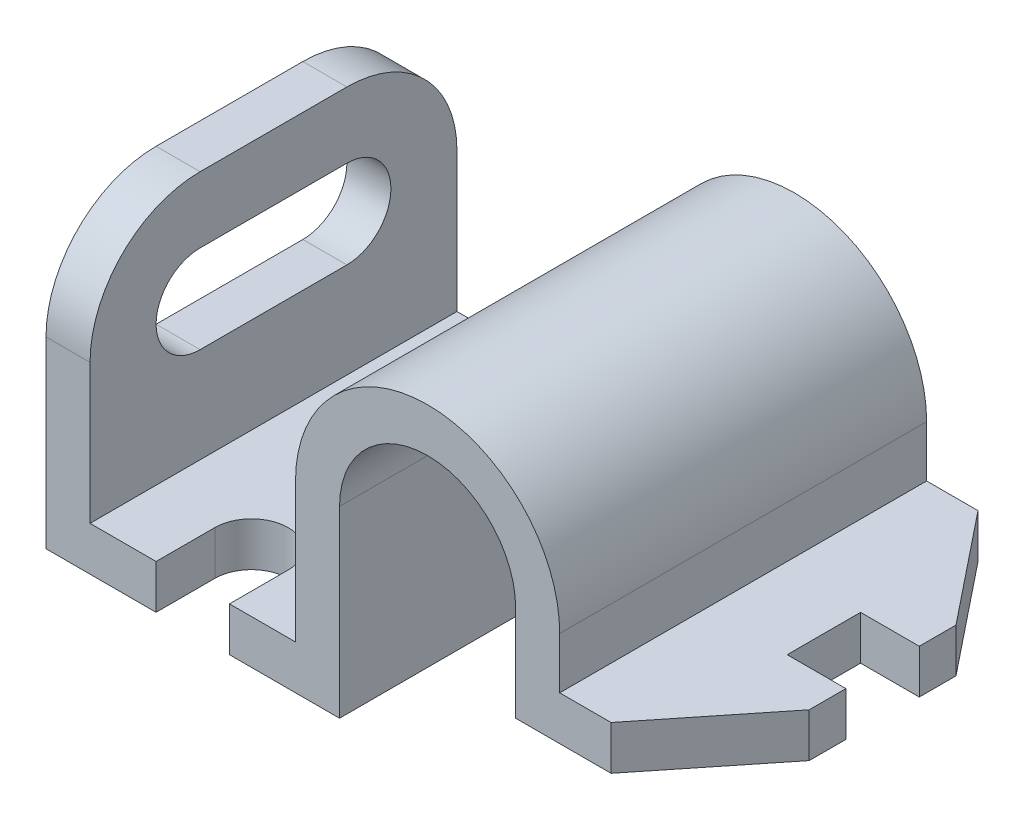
from build123d import *

# Parameters (mm, degrees)
EXTRUIR_L_MINA1_DEPTH       = 25
CORTAR_EXTRUIR1_REACH       = 103.956
CORTAR_EXTRUIR2_DEPTH       = 100.574093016
CROQUIS4_W                  = 8
CROQUIS4_H                  = 10
CORTAR_EXTRUIR3_DEPTH       = 96.765338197
REDONDEO1_R                 = 15
CHAFL_N1_SIZE               = 12
CHAFL_N1_SIZE2              = 15
REDONDEO1_OF_SIMETR_A2_R    = 15
CHAFL_N1_OF_SIMETR_A2_SIZE2 = 15
CHAFL_N1_OF_SIMETR_A2_SIZE  = 12


with BuildPart() as part:
    # Croquis1 → Extruir-L_mina1 (new, symmetric)
    with BuildSketch(Plane.XY):
        with BuildLine():
            Line((0, 40), (0, 0))
            Line((0, 0), (40, 0))
            Line((40, 0), (40, 25))
            ThreePointArc((40, 25), (52, 37), (64, 25))
            Line((64, 25), (64, 12))
            Line((64, 12), (89, 12))
            Line((89, 12), (89, 18))
            Line((89, 18), (70, 18))
            Line((70, 18), (70, 25))
            ThreePointArc((70, 25), (52, 43), (34, 25))
            Line((34, 25), (34, 6))
            Line((34, 6), (6, 6))
            Line((6, 6), (6, 40))
            Line((6, 40), (0, 40))
        make_face()
    extrude(amount=EXTRUIR_L_MINA1_DEPTH, both=True)

    # Croquis2 → Cortar-Extruir1 (cut, up to next)
    with BuildSketch(Plane.ZY, mode=Mode.PRIVATE) as cortar_extruir1_sk1:
        with BuildLine():
            Line((-10, 31), (10, 31))
            ThreePointArc((10, 31), (16, 25), (10, 19))
            Line((10, 19), (-10, 19))
            ThreePointArc((-10, 19), (-16, 25), (-10, 31))
        make_face()
    cortar_extruir1_tool1 = extrude(cortar_extruir1_sk1.sketch, amount=-CORTAR_EXTRUIR1_REACH, mode=Mode.PRIVATE) & part.part
    add(cortar_extruir1_tool1.solids().sort_by_distance((0, 25, 0))[0], mode=Mode.SUBTRACT)

    # Croquis3 → Cortar-Extruir2 (cut, through all)
    with BuildSketch(Plane(origin=(0, 6, 0), x_dir=(1, 0, 0), z_dir=(0, 1, 0))):
        with BuildLine():
            Line((15, -25), (15, -17))
            ThreePointArc((15, -17), (20, -12), (25, -17))
            Line((25, -17), (25, -25))
            Line((25, -25), (15, -25))
        make_face()
    cortar_extruir2 = extrude(amount=-CORTAR_EXTRUIR2_DEPTH, mode=Mode.SUBTRACT)

    # Croquis4 → Cortar-Extruir3 (cut, through all)
    with BuildSketch(Plane(origin=(0, 18, 0), x_dir=(1, 0, 0), z_dir=(0, 1, 0))):
        with Locations((85, 0)):
            Rectangle(CROQUIS4_W, CROQUIS4_H)
    extrude(amount=-CORTAR_EXTRUIR3_DEPTH, mode=Mode.SUBTRACT)

    # Redondeo1
    redondeo1_edges = [part.edges().sort_by_distance(p)[0] for p in [
        (3, 40, 25),
    ]]
    fillet(redondeo1_edges, radius=REDONDEO1_R)

    # Chafl_n1
    chafl_n1_edges = [part.edges().sort_by_distance(p)[0] for p in [
        (89, 15, 25),
    ]]
    chafl_n1_side = [part.faces().sort_by_distance(p)[0] for p in [
        (52, 42.228961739, 25),
    ]]
    chamfer(chafl_n1_edges, length=CHAFL_N1_SIZE, length2=CHAFL_N1_SIZE2, reference=chafl_n1_side[0])

    # Simetr_a2: Cortar-Extruir2 across plane
    add(cortar_extruir2.mirror(Plane.XY), mode=Mode.SUBTRACT)

    # Redondeo1 of Simetr_a2
    redondeo1_of_simetr_a2_edges = [part.edges().sort_by_distance(p)[0] for p in [
        (3, 40, -25),
    ]]
    fillet(redondeo1_of_simetr_a2_edges, radius=REDONDEO1_OF_SIMETR_A2_R)

    # Chafl_n1 of Simetr_a2
    chafl_n1_of_simetr_a2_edges = [part.edges().sort_by_distance(p)[0] for p in [
        (89, 15, -25),
    ]]
    chamfer(chafl_n1_of_simetr_a2_edges, length=CHAFL_N1_OF_SIMETR_A2_SIZE, length2=CHAFL_N1_OF_SIMETR_A2_SIZE2)


solid = part.part
